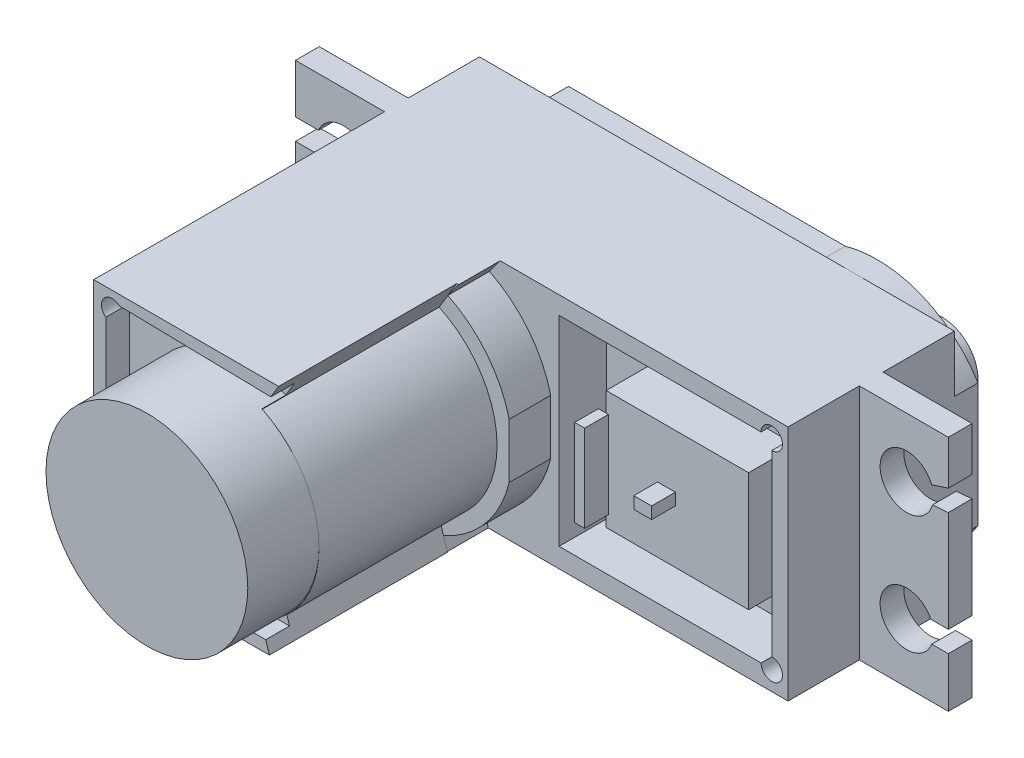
from build123d import *

# Parameters (mm, degrees)
BOSS_EXTRUDE1_DEPTH = 20
SKETCH2_R           = 6.523212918
BOSS_EXTRUDE2_DEPTH = 0.5
SKETCH3_R           = 3
BOSS_EXTRUDE3_DEPTH = 5
SKETCH4_W           = 56.386793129
SKETCH4_H           = 31.830315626
CUT_EXTRUDE2_DEPTH  = 2
CUT_EXTRUDE3_DEPTH  = 12
SKETCH6_W           = 20
SKETCH6_H           = 29.315906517
CUT_EXTRUDE4_DEPTH  = 22
SKETCH7_W           = 17.916735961
SKETCH7_H           = 16.852375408
SKETCH7_W_2         = 12
SKETCH7_H_2         = 10
CUT_EXTRUDE5_DEPTH  = 4
SKETCH8_W           = 1.5
SKETCH8_H           = 1
SKETCH8_W_2         = 0.841670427
SKETCH8_H_2         = 7.316449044
BOSS_EXTRUDE4_DEPTH = 2
SKETCH9_W           = 32.782305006
SKETCH9_H           = 37.110704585
SKETCH9_R           = 8.5
CUT_EXTRUDE6_DEPTH  = 6
CUT_EXTRUDE7_DEPTH  = 15
CUT_EXTRUDE8_DEPTH  = 3.5
CUT_EXTRUDE9_DEPTH  = 2
SKETCH13_R          = 0.9
CUT_EXTRUDE10_DEPTH = 35


with BuildPart() as part:
    # Sketch1 → Boss-Extrude1 (new body)
    with BuildSketch(Plane(origin=(0, 0, 0), x_dir=(1, 0, 0), z_dir=(0, 1, 0))):
        Polygon((28.739495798, 3.613445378), (36.239495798, 3.613445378), (36.239495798, 5.613445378), (28.739495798, 5.613445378), (28.739495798, 13.613445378), (-11.260504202, 13.613445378), (-11.260504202, 5.613445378), (-18.760504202, 5.613445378), (-18.760504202, 3.613445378), (-11.260504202, 3.613445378), (-11.260504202, -26.886554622), (28.739495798, -26.886554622), align=None)
    extrude(amount=BOSS_EXTRUDE1_DEPTH)

    # Sketch2 → Boss-Extrude2 (add)
    with BuildSketch(Plane(origin=(0, 0, -13.613445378), x_dir=(-1, 0, 0), z_dir=(0, 0, -1))):
        with Locations(Location((-20.239495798, 10, 0), (0, 0, 180))):
            Circle(SKETCH2_R)
    extrude(amount=BOSS_EXTRUDE2_DEPTH)

    # Sketch3 → Boss-Extrude3 (add)
    with BuildSketch(Plane(origin=(0, 0, -14.113445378), x_dir=(-1, 0, 0), z_dir=(0, 0, -1))):
        with Locations((-20.239495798, 10)):
            Circle(SKETCH3_R)
    extrude(amount=BOSS_EXTRUDE3_DEPTH)

    # Sketch4 → Cut-Extrude2 (cut)
    with BuildSketch(Plane(origin=(0, 0, -13.613445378), x_dir=(-1, 0, 0), z_dir=(0, 0, -1))):
        with Locations((-8.504192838, 10.243497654)):
            Rectangle(SKETCH4_W, SKETCH4_H)
        with BuildLine():
            Line((-17.550035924, 19.601207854), (5.760504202, 19.601207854))
            Line((5.760504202, 19.601207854), (5.760504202, 12.919964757))
            ThreePointArc((5.760504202, 12.919964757), (6.995421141, 9.823316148), (5.760504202, 6.72666754))
            Line((5.760504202, 6.72666754), (5.760504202, 0.398792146))
            Line((5.760504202, 0.398792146), (-17.550035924, 0.398792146))
            ThreePointArc((-17.550035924, 0.398792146), (-30.210272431, 10), (-17.550035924, 19.601207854))
        make_face(mode=Mode.SUBTRACT)
    extrude(amount=-CUT_EXTRUDE2_DEPTH, mode=Mode.SUBTRACT)

    # Sketch5 → Cut-Extrude3 (cut)
    with BuildSketch(Plane(origin=(0, 0, -5.613445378), x_dir=(-1, 0, 0), z_dir=(0, 0, -1))):
        with BuildLine():
            Line((-37.081033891, 14.576966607), (-34.907103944, 14.396696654))
            ThreePointArc((-34.907103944, 14.396696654), (-30.492553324, 14.882741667), (-34.832533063, 15.825648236))
            Line((-34.832533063, 15.825648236), (-37.081033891, 16.561503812))
            Line((-37.081033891, 16.561503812), (-37.081033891, 14.576966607))
        make_face()
        with BuildLine():
            Line((-34.844815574, 4.206193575), (-37.165580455, 4.206193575))
            Line((-37.165580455, 4.206193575), (-37.165580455, 5.987383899))
            Line((-37.165580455, 5.987383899), (-34.76696044, 5.97564703))
            ThreePointArc((-34.76696044, 5.97564703), (-30.491670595, 4.90109673), (-34.844815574, 4.206193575))
        make_face()
        with BuildLine():
            Line((16.817894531, 15.87095326), (19.632703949, 15.87095326))
            Line((19.632703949, 15.87095326), (19.632703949, 14.086819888))
            Line((19.632703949, 14.086819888), (16.799657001, 14.086819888))
            ThreePointArc((16.799657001, 14.086819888), (12.493418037, 15.022998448), (16.817894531, 15.87095326))
        make_face()
        with BuildLine():
            Line((16.817894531, 5.910848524), (19.86360893, 5.910848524))
            Line((19.86360893, 5.910848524), (19.86360893, 4.206193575))
            Line((19.86360893, 4.206193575), (16.926247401, 4.390035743))
            ThreePointArc((16.926247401, 4.390035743), (12.516193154, 4.840100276), (16.817894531, 5.910848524))
        make_face()
    extrude(amount=-CUT_EXTRUDE3_DEPTH, mode=Mode.SUBTRACT)

    # Sketch6 → Cut-Extrude4 (cut)
    with BuildSketch(Plane.XZ):
        with Locations((18.739495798, 17.04450788)):
            Rectangle(SKETCH6_W, SKETCH6_H)
    extrude(amount=-CUT_EXTRUDE4_DEPTH, mode=Mode.SUBTRACT)

    # Sketch7 → Cut-Extrude5 (cut)
    with BuildSketch(Plane.XY.offset(2.386554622)):
        with Locations((18.407437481, 10.07121862)):
            Rectangle(SKETCH7_W, SKETCH7_H)
        with Locations((19.414477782, 10)):
            Rectangle(SKETCH7_W_2, SKETCH7_H_2, mode=Mode.SUBTRACT)
    extrude(amount=-CUT_EXTRUDE5_DEPTH, mode=Mode.SUBTRACT)

    # Sketch8 → Boss-Extrude4 (add)
    with BuildSketch(Plane.XY.offset(2.386554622)):
        with Locations((18.489495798, 9.988423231)):
            Rectangle(SKETCH8_W, SKETCH8_H)
        with Locations((13.181103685, 9.688151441)):
            Rectangle(SKETCH8_W_2, SKETCH8_H_2)
    extrude(amount=BOSS_EXTRUDE4_DEPTH)

    # Sketch9 → Cut-Extrude6 (cut)
    with BuildSketch(Plane.XY.offset(26.886554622)):
        with Locations((1.147057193, 8.398561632)):
            Rectangle(SKETCH9_W, SKETCH9_H)
        with Locations((-0.780618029, 10)):
            Circle(SKETCH9_R, mode=Mode.SUBTRACT)
    extrude(amount=-CUT_EXTRUDE6_DEPTH, mode=Mode.SUBTRACT)

    # Sketch10 → Cut-Extrude7 (cut)
    with BuildSketch(Plane.XY.offset(20.886554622)):
        with BuildLine():
            Line((6.669905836, 23.904782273), (2.84193586, 17.543298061))
            ThreePointArc((2.84193586, 17.543298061), (7.720089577, 9.89070167), (2.84193586, 2.238105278))
            Line((2.84193586, 2.238105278), (4.755920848, -3.945985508))
            Line((4.755920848, -3.945985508), (11.577790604, -3.945985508))
            Line((11.577790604, -3.945985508), (11.577790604, 23.13607743))
            Line((11.577790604, 23.13607743), (6.669905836, 23.904782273))
        make_face()
    extrude(amount=-CUT_EXTRUDE7_DEPTH, mode=Mode.SUBTRACT)

    # Sketch11 → Cut-Extrude8 (cut)
    with BuildSketch(Plane.XY.offset(5.886554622)):
        with BuildLine():
            Line((3.581085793, 18.771649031), (7.438610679, 24.024881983))
            Line((7.438610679, 24.024881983), (11.72233027, 23.510835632))
            Line((11.72233027, 23.510835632), (11.72233027, -4.535459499))
            Line((11.72233027, -4.535459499), (4.659447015, -4.535459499))
            Line((4.659447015, -4.535459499), (3.205841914, 1.051568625))
            ThreePointArc((3.205841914, 1.051568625), (9.013424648, 9.792599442), (3.581085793, 18.771649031))
        make_face()
    extrude(amount=-CUT_EXTRUDE8_DEPTH, mode=Mode.SUBTRACT)

    # Sketch12 → Cut-Extrude9 (cut)
    with BuildSketch(Plane.XY.offset(20.886554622)):
        with BuildLine():
            Line((-10.241600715, 19.18947245), (7.261217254, 18.834685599))
            Line((7.261217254, 18.834685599), (5.579705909, 15.638818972))
            ThreePointArc((5.579705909, 15.638818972), (-9.246576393, 10.759966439), (4.473749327, 3.318561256))
            Line((4.473749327, 3.318561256), (6.315118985, 0.97708078))
            Line((6.315118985, 0.97708078), (-10.241600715, 0.97708078))
            Line((-10.241600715, 0.97708078), (-10.241600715, 19.18947245))
        make_face()
    extrude(amount=-CUT_EXTRUDE9_DEPTH, mode=Mode.SUBTRACT)

    # Sketch13 → Cut-Extrude10 (cut)
    with BuildSketch(Plane.XY.offset(26.886554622)):
        with Locations((27.365805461, 18.497406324)):
            Circle(SKETCH13_R)
        with Locations((27.365805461, 1.645030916)):
            Circle(SKETCH13_R)
        with Locations((-9.709420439, 18.497406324)):
            Circle(SKETCH13_R)
        with Locations((-9.709420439, 1.645030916)):
            Circle(SKETCH13_R)
    extrude(amount=-CUT_EXTRUDE10_DEPTH, mode=Mode.SUBTRACT)


solid = part.part
